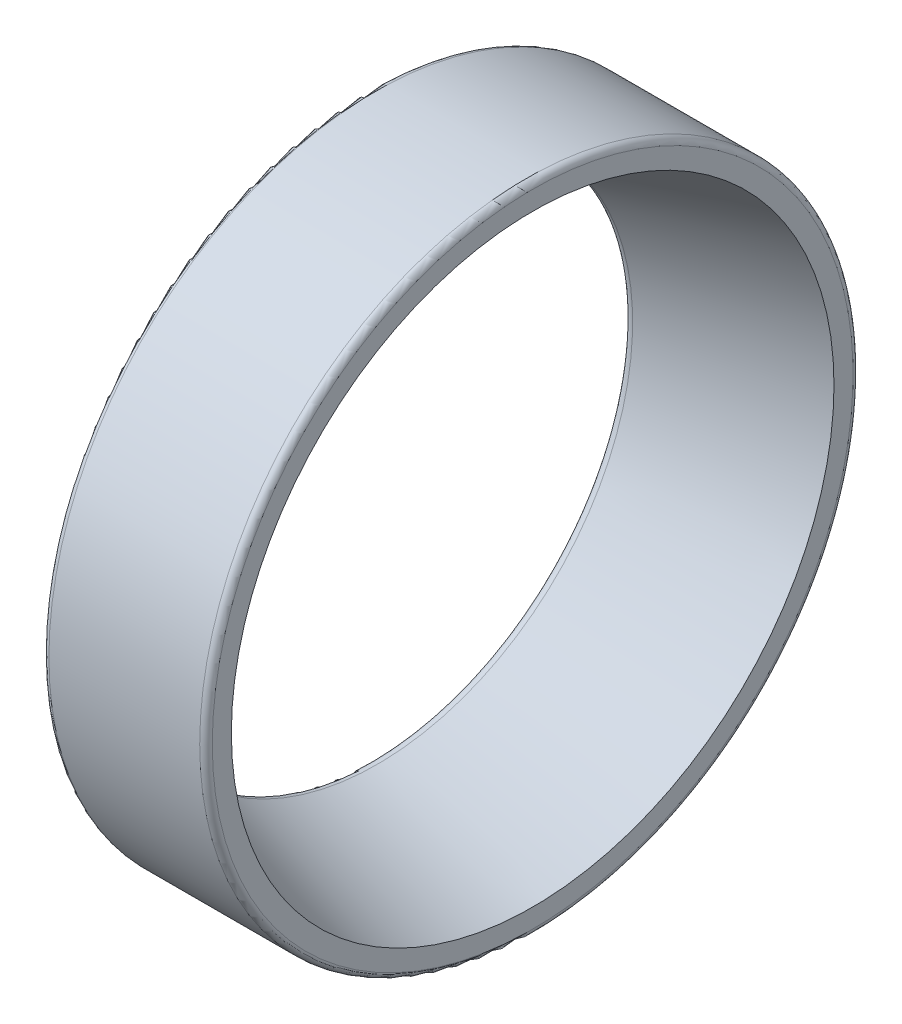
ISO-10303-21;
HEADER;
FILE_DESCRIPTION(('STEP AP214'),'2;1');
FILE_NAME('part.step','',(''),(''),'','','');
FILE_SCHEMA(('AUTOMOTIVE_DESIGN { 1 0 10303 214 1 1 1 1 }'));
ENDSEC;
DATA;
#1=APPLICATION_CONTEXT('core data for automotive mechanical design processes');
#2=APPLICATION_PROTOCOL_DEFINITION('international standard','automotive_design',2000,#1);
#3=PRODUCT_CONTEXT('',#1,'mechanical');
#4=PRODUCT('Part','Part','',(#3));
#5=PRODUCT_RELATED_PRODUCT_CATEGORY('part','',(#4));
#6=PRODUCT_DEFINITION_FORMATION('','',#4);
#7=PRODUCT_DEFINITION_CONTEXT('part definition',#1,'design');
#8=PRODUCT_DEFINITION('design','',#6,#7);
#9=PRODUCT_DEFINITION_SHAPE('','',#8);
#10=(LENGTH_UNIT() NAMED_UNIT(*) SI_UNIT(.MILLI.,.METRE.));
#11=(NAMED_UNIT(*) PLANE_ANGLE_UNIT() SI_UNIT($,.RADIAN.));
#12=(NAMED_UNIT(*) SI_UNIT($,.STERADIAN.) SOLID_ANGLE_UNIT());
#13=UNCERTAINTY_MEASURE_WITH_UNIT(LENGTH_MEASURE(1.E-05),#10,'distance_accuracy_value','');
#14=(GEOMETRIC_REPRESENTATION_CONTEXT(3) GLOBAL_UNCERTAINTY_ASSIGNED_CONTEXT((#13)) GLOBAL_UNIT_ASSIGNED_CONTEXT((#10,
#11,#12)) REPRESENTATION_CONTEXT('',''));
#15=CARTESIAN_POINT('',(0.,0.,0.));
#16=DIRECTION('',(0.,0.,1.));
#17=DIRECTION('',(1.,0.,0.));
#18=AXIS2_PLACEMENT_3D('',#15,#16,#17);
#19=CARTESIAN_POINT('',(0.5,0.,0.));
#20=DIRECTION('',(-1.,0.,0.));
#21=DIRECTION('',(0.,0.,1.));
#22=AXIS2_PLACEMENT_3D('',#19,#20,#21);
#23=TOROIDAL_SURFACE('',#22,20.797341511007,0.500000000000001);
#24=CARTESIAN_POINT('',(0.64208970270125,0.,0.));
#25=DIRECTION('',(-1.,0.,0.));
#26=DIRECTION('',(0.,0.,1.));
#27=AXIS2_PLACEMENT_3D('',#24,#25,#26);
#28=CIRCLE('',#27,20.3179559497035);
#29=CARTESIAN_POINT('',(0.64208970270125,0.,20.3179559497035));
#30=VERTEX_POINT('',#29);
#31=EDGE_CURVE('E10',#30,#30,#28,.T.);
#32=ORIENTED_EDGE('',*,*,#31,.F.);
#33=EDGE_LOOP('',(#32));
#34=FACE_BOUND('',#33,.T.);
#35=CARTESIAN_POINT('',(0.,0.,0.));
#36=DIRECTION('',(-1.,0.,0.));
#37=DIRECTION('',(0.,0.,1.));
#38=AXIS2_PLACEMENT_3D('',#35,#36,#37);
#39=CIRCLE('',#38,20.797341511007);
#40=CARTESIAN_POINT('',(0.,0.,20.797341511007));
#41=VERTEX_POINT('',#40);
#42=EDGE_CURVE('E54',#41,#41,#39,.T.);
#43=ORIENTED_EDGE('',*,*,#42,.T.);
#44=EDGE_LOOP('',(#43));
#45=FACE_BOUND('',#44,.T.);
#46=ADVANCED_FACE('F29',(#34,#45),#23,.T.);
#47=CARTESIAN_POINT('',(11.4231207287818,0.,0.));
#48=DIRECTION('',(1.,0.,0.));
#49=DIRECTION('',(0.,0.,-1.));
#50=AXIS2_PLACEMENT_3D('',#47,#48,#49);
#51=CONICAL_SURFACE('',#50,23.5134495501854,0.288150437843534);
#52=CARTESIAN_POINT('',(13.,0.,0.));
#53=DIRECTION('',(-1.,0.,0.));
#54=DIRECTION('',(0.,0.,1.));
#55=AXIS2_PLACEMENT_3D('',#52,#53,#54);
#56=CIRCLE('',#55,23.980835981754);
#57=CARTESIAN_POINT('',(13.,0.,23.980835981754));
#58=VERTEX_POINT('',#57);
#59=EDGE_CURVE('E35',#58,#58,#56,.T.);
#60=ORIENTED_EDGE('',*,*,#59,.F.);
#61=EDGE_LOOP('',(#60));
#62=FACE_BOUND('',#61,.T.);
#63=ORIENTED_EDGE('',*,*,#31,.T.);
#64=EDGE_LOOP('',(#63));
#65=FACE_BOUND('',#64,.T.);
#66=ADVANCED_FACE('F85',(#62,#65),#51,.F.);
#67=CARTESIAN_POINT('',(13.,0.,-25.5));
#68=DIRECTION('',(-1.,0.,0.));
#69=DIRECTION('',(0.,0.,1.));
#70=AXIS2_PLACEMENT_3D('',#67,#68,#69);
#71=PLANE('',#70);
#72=CARTESIAN_POINT('',(13.,0.,0.));
#73=DIRECTION('',(-1.,0.,0.));
#74=DIRECTION('',(0.,0.,1.));
#75=AXIS2_PLACEMENT_3D('',#72,#73,#74);
#76=CIRCLE('',#75,25.5);
#77=CARTESIAN_POINT('',(13.,0.,25.5));
#78=VERTEX_POINT('',#77);
#79=EDGE_CURVE('E39',#78,#78,#76,.T.);
#80=ORIENTED_EDGE('',*,*,#79,.F.);
#81=EDGE_LOOP('',(#80));
#82=FACE_BOUND('',#81,.T.);
#83=ORIENTED_EDGE('',*,*,#59,.T.);
#84=EDGE_LOOP('',(#83));
#85=FACE_BOUND('',#84,.T.);
#86=ADVANCED_FACE('F80',(#82,#85),#71,.F.);
#87=CARTESIAN_POINT('',(12.5,0.,0.));
#88=DIRECTION('',(-1.,0.,0.));
#89=DIRECTION('',(0.,0.,1.));
#90=AXIS2_PLACEMENT_3D('',#87,#88,#89);
#91=TOROIDAL_SURFACE('',#90,25.5,0.5);
#92=CARTESIAN_POINT('',(12.5,0.,0.));
#93=DIRECTION('',(-1.,0.,0.));
#94=DIRECTION('',(0.,0.,1.));
#95=AXIS2_PLACEMENT_3D('',#92,#93,#94);
#96=CIRCLE('',#95,26.);
#97=CARTESIAN_POINT('',(12.5,0.,26.));
#98=VERTEX_POINT('',#97);
#99=EDGE_CURVE('E43',#98,#98,#96,.T.);
#100=ORIENTED_EDGE('',*,*,#99,.F.);
#101=EDGE_LOOP('',(#100));
#102=FACE_BOUND('',#101,.T.);
#103=ORIENTED_EDGE('',*,*,#79,.T.);
#104=EDGE_LOOP('',(#103));
#105=FACE_BOUND('',#104,.T.);
#106=ADVANCED_FACE('F74',(#102,#105),#91,.T.);
#107=CARTESIAN_POINT('',(0.,0.,0.));
#108=DIRECTION('',(-1.,0.,0.));
#109=DIRECTION('',(0.,0.,1.));
#110=AXIS2_PLACEMENT_3D('',#107,#108,#109);
#111=CYLINDRICAL_SURFACE('',#110,26.);
#112=CARTESIAN_POINT('',(0.5,0.,0.));
#113=DIRECTION('',(-1.,0.,0.));
#114=DIRECTION('',(0.,0.,1.));
#115=AXIS2_PLACEMENT_3D('',#112,#113,#114);
#116=CIRCLE('',#115,26.);
#117=CARTESIAN_POINT('',(0.5,0.,26.));
#118=VERTEX_POINT('',#117);
#119=EDGE_CURVE('E48',#118,#118,#116,.T.);
#120=ORIENTED_EDGE('',*,*,#119,.F.);
#121=EDGE_LOOP('',(#120));
#122=FACE_BOUND('',#121,.T.);
#123=ORIENTED_EDGE('',*,*,#99,.T.);
#124=EDGE_LOOP('',(#123));
#125=FACE_BOUND('',#124,.T.);
#126=ADVANCED_FACE('F68',(#122,#125),#111,.T.);
#127=CARTESIAN_POINT('',(0.5,0.,0.));
#128=DIRECTION('',(-1.,0.,0.));
#129=DIRECTION('',(0.,0.,1.));
#130=AXIS2_PLACEMENT_3D('',#127,#128,#129);
#131=TOROIDAL_SURFACE('',#130,25.5,0.5);
#132=CARTESIAN_POINT('',(0.,0.,0.));
#133=DIRECTION('',(-1.,0.,0.));
#134=DIRECTION('',(0.,0.,1.));
#135=AXIS2_PLACEMENT_3D('',#132,#133,#134);
#136=CIRCLE('',#135,25.5);
#137=CARTESIAN_POINT('',(0.,0.,25.5));
#138=VERTEX_POINT('',#137);
#139=EDGE_CURVE('E51',#138,#138,#136,.T.);
#140=ORIENTED_EDGE('',*,*,#139,.F.);
#141=EDGE_LOOP('',(#140));
#142=FACE_BOUND('',#141,.T.);
#143=ORIENTED_EDGE('',*,*,#119,.T.);
#144=EDGE_LOOP('',(#143));
#145=FACE_BOUND('',#144,.T.);
#146=ADVANCED_FACE('F62',(#142,#145),#131,.T.);
#147=CARTESIAN_POINT('',(0.,0.,-20.797341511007));
#148=DIRECTION('',(1.,0.,0.));
#149=DIRECTION('',(0.,0.,-1.));
#150=AXIS2_PLACEMENT_3D('',#147,#148,#149);
#151=PLANE('',#150);
#152=ORIENTED_EDGE('',*,*,#42,.F.);
#153=EDGE_LOOP('',(#152));
#154=FACE_BOUND('',#153,.T.);
#155=ORIENTED_EDGE('',*,*,#139,.T.);
#156=EDGE_LOOP('',(#155));
#157=FACE_BOUND('',#156,.T.);
#158=ADVANCED_FACE('F59',(#154,#157),#151,.F.);
#159=CLOSED_SHELL('',(#46,#66,#86,#106,#126,#146,#158));
#160=MANIFOLD_SOLID_BREP('B2',#159);
#161=ADVANCED_BREP_SHAPE_REPRESENTATION('',(#18,#160),#14);
#162=SHAPE_DEFINITION_REPRESENTATION(#9,#161);
ENDSEC;
END-ISO-10303-21;
